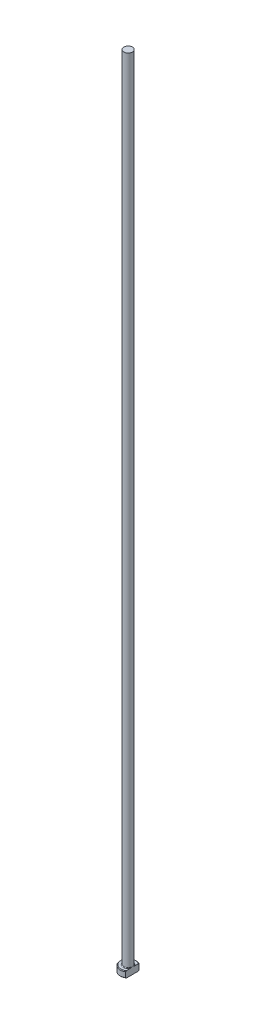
ISO-10303-21;
HEADER;
FILE_DESCRIPTION(('STEP AP214'),'2;1');
FILE_NAME('part.step','',(''),(''),'','','');
FILE_SCHEMA(('AUTOMOTIVE_DESIGN { 1 0 10303 214 1 1 1 1 }'));
ENDSEC;
DATA;
#1=APPLICATION_CONTEXT('core data for automotive mechanical design processes');
#2=APPLICATION_PROTOCOL_DEFINITION('international standard','automotive_design',2000,#1);
#3=PRODUCT_CONTEXT('',#1,'mechanical');
#4=PRODUCT('Part','Part','',(#3));
#5=PRODUCT_RELATED_PRODUCT_CATEGORY('part','',(#4));
#6=PRODUCT_DEFINITION_FORMATION('','',#4);
#7=PRODUCT_DEFINITION_CONTEXT('part definition',#1,'design');
#8=PRODUCT_DEFINITION('design','',#6,#7);
#9=PRODUCT_DEFINITION_SHAPE('','',#8);
#10=(LENGTH_UNIT() NAMED_UNIT(*) SI_UNIT(.MILLI.,.METRE.));
#11=(NAMED_UNIT(*) PLANE_ANGLE_UNIT() SI_UNIT($,.RADIAN.));
#12=(NAMED_UNIT(*) SI_UNIT($,.STERADIAN.) SOLID_ANGLE_UNIT());
#13=UNCERTAINTY_MEASURE_WITH_UNIT(LENGTH_MEASURE(1.E-05),#10,'distance_accuracy_value','');
#14=(GEOMETRIC_REPRESENTATION_CONTEXT(3) GLOBAL_UNCERTAINTY_ASSIGNED_CONTEXT((#13)) GLOBAL_UNIT_ASSIGNED_CONTEXT((#10,
#11,#12)) REPRESENTATION_CONTEXT('',''));
#15=CARTESIAN_POINT('',(0.,0.,0.));
#16=DIRECTION('',(0.,0.,1.));
#17=DIRECTION('',(1.,0.,0.));
#18=AXIS2_PLACEMENT_3D('',#15,#16,#17);
#19=CARTESIAN_POINT('',(0.,0.,0.));
#20=DIRECTION('',(0.,-1.,0.));
#21=DIRECTION('',(0.,0.,-1.));
#22=AXIS2_PLACEMENT_3D('',#19,#20,#21);
#23=PLANE('',#22);
#24=CARTESIAN_POINT('',(0.,0.,0.));
#25=DIRECTION('',(0.,-1.,0.));
#26=DIRECTION('',(0.,0.,-1.));
#27=AXIS2_PLACEMENT_3D('',#24,#25,#26);
#28=CIRCLE('',#27,2.3);
#29=CARTESIAN_POINT('',(1.34999999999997,0.,1.86212244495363));
#30=VERTEX_POINT('',#29);
#31=CARTESIAN_POINT('',(1.34999999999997,0.,-1.86212244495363));
#32=VERTEX_POINT('',#31);
#33=EDGE_CURVE('E98',#30,#32,#28,.T.);
#34=ORIENTED_EDGE('',*,*,#33,.T.);
#35=DIRECTION('',(0.,0.,1.));
#36=VECTOR('',#35,1.);
#37=CARTESIAN_POINT('',(1.34999999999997,0.,-2.10416254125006));
#38=LINE('',#37,#36);
#39=EDGE_CURVE('E83',#32,#30,#38,.T.);
#40=ORIENTED_EDGE('',*,*,#39,.T.);
#41=EDGE_LOOP('',(#34,#40));
#42=FACE_BOUND('',#41,.T.);
#43=ADVANCED_FACE('F32',(#42),#23,.T.);
#44=CARTESIAN_POINT('',(0.,259.958771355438,0.));
#45=DIRECTION('',(0.,1.,0.));
#46=DIRECTION('',(0.,0.,1.));
#47=AXIS2_PLACEMENT_3D('',#44,#45,#46);
#48=CYLINDRICAL_SURFACE('',#47,2.49999999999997);
#49=CARTESIAN_POINT('',(0.,1.79999999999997,0.));
#50=DIRECTION('',(0.,1.,0.));
#51=DIRECTION('',(0.,0.,1.));
#52=AXIS2_PLACEMENT_3D('',#49,#50,#51);
#53=CIRCLE('',#52,2.49999999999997);
#54=CARTESIAN_POINT('',(1.34999999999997,1.79999999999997,2.10416254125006));
#55=VERTEX_POINT('',#54);
#56=CARTESIAN_POINT('',(1.34999999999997,1.79999999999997,-2.10416254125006));
#57=VERTEX_POINT('',#56);
#58=EDGE_CURVE('E104',#55,#57,#53,.F.);
#59=ORIENTED_EDGE('',*,*,#58,.T.);
#60=DIRECTION('',(0.,-1.,0.));
#61=VECTOR('',#60,1.);
#62=CARTESIAN_POINT('',(1.34999999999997,250.,-2.10416254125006));
#63=LINE('',#62,#61);
#64=CARTESIAN_POINT('',(1.34999999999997,0.199999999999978,-2.10416254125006));
#65=VERTEX_POINT('',#64);
#66=EDGE_CURVE('E183',#57,#65,#63,.T.);
#67=ORIENTED_EDGE('',*,*,#66,.T.);
#68=CARTESIAN_POINT('',(0.,0.199999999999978,0.));
#69=DIRECTION('',(0.,-1.,0.));
#70=DIRECTION('',(0.,0.,-1.));
#71=AXIS2_PLACEMENT_3D('',#68,#69,#70);
#72=CIRCLE('',#71,2.49999999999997);
#73=CARTESIAN_POINT('',(1.34999999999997,0.199999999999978,2.10416254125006));
#74=VERTEX_POINT('',#73);
#75=EDGE_CURVE('E100',#65,#74,#72,.F.);
#76=ORIENTED_EDGE('',*,*,#75,.T.);
#77=DIRECTION('',(0.,-1.,0.));
#78=VECTOR('',#77,1.);
#79=CARTESIAN_POINT('',(1.34999999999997,250.,2.10416254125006));
#80=LINE('',#79,#78);
#81=EDGE_CURVE('E93',#55,#74,#80,.T.);
#82=ORIENTED_EDGE('',*,*,#81,.F.);
#83=EDGE_LOOP('',(#59,#67,#76,#82));
#84=FACE_BOUND('',#83,.T.);
#85=ADVANCED_FACE('F158',(#84),#48,.T.);
#86=CARTESIAN_POINT('',(-2.49999999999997,2.,0.));
#87=DIRECTION('',(0.,1.,0.));
#88=DIRECTION('',(0.,0.,1.));
#89=AXIS2_PLACEMENT_3D('',#86,#87,#88);
#90=PLANE('',#89);
#91=CARTESIAN_POINT('',(0.,2.,0.));
#92=DIRECTION('',(0.,1.,0.));
#93=DIRECTION('',(0.,0.,1.));
#94=AXIS2_PLACEMENT_3D('',#91,#92,#93);
#95=CIRCLE('',#94,2.29999999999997);
#96=CARTESIAN_POINT('',(1.34999999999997,2.,-1.86212244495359));
#97=VERTEX_POINT('',#96);
#98=CARTESIAN_POINT('',(1.34999999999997,2.,1.86212244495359));
#99=VERTEX_POINT('',#98);
#100=EDGE_CURVE('E178',#97,#99,#95,.T.);
#101=ORIENTED_EDGE('',*,*,#100,.T.);
#102=DIRECTION('',(0.,0.,-1.));
#103=VECTOR('',#102,1.);
#104=CARTESIAN_POINT('',(1.34999999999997,2.,0.));
#105=LINE('',#104,#103);
#106=CARTESIAN_POINT('',(1.34999999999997,1.99999999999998,0.761577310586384));
#107=VERTEX_POINT('',#106);
#108=EDGE_CURVE('E57',#99,#107,#105,.T.);
#109=ORIENTED_EDGE('',*,*,#108,.T.);
#110=CARTESIAN_POINT('',(0.,2.,0.));
#111=DIRECTION('',(0.,1.,0.));
#112=DIRECTION('',(0.,0.,1.));
#113=AXIS2_PLACEMENT_3D('',#110,#111,#112);
#114=CIRCLE('',#113,1.54999999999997);
#115=CARTESIAN_POINT('',(1.34999999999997,1.99999999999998,-0.761577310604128));
#116=VERTEX_POINT('',#115);
#117=EDGE_CURVE('E107',#107,#116,#114,.F.);
#118=ORIENTED_EDGE('',*,*,#117,.T.);
#119=EDGE_CURVE('E136',#116,#97,#105,.T.);
#120=ORIENTED_EDGE('',*,*,#119,.T.);
#121=EDGE_LOOP('',(#101,#109,#118,#120));
#122=FACE_BOUND('',#121,.T.);
#123=ADVANCED_FACE('F147',(#122),#90,.T.);
#124=CARTESIAN_POINT('',(0.,2.,0.));
#125=DIRECTION('',(0.,-1.,0.));
#126=DIRECTION('',(0.,0.,-1.));
#127=AXIS2_PLACEMENT_3D('',#124,#125,#126);
#128=CONICAL_SURFACE('',#127,2.29999999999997,0.785398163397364);
#129=ORIENTED_EDGE('',*,*,#58,.F.);
#130=CARTESIAN_POINT('',(1.34999999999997,-0.524919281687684,4.63220747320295));
#131=CARTESIAN_POINT('',(1.34999999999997,-0.43760934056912,4.54126266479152));
#132=CARTESIAN_POINT('',(1.34999999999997,-0.350401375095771,4.45021982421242));
#133=CARTESIAN_POINT('',(1.34999999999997,-0.176235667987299,4.26789371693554));
#134=CARTESIAN_POINT('',(1.34999999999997,-0.0892779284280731,4.17661044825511));
#135=CARTESIAN_POINT('',(1.34999999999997,0.171198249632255,3.90228319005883));
#136=CARTESIAN_POINT('',(1.34999999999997,0.344269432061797,3.71881394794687));
#137=CARTESIAN_POINT('',(1.34999999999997,0.686339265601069,3.35265578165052));
#138=CARTESIAN_POINT('',(1.34999999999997,0.855361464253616,3.16998895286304));
#139=CARTESIAN_POINT('',(1.34999999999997,1.10676804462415,2.89407002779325));
#140=CARTESIAN_POINT('',(1.34999999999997,1.19021072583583,2.8017829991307));
#141=CARTESIAN_POINT('',(1.34999999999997,1.35616107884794,2.61637299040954));
#142=CARTESIAN_POINT('',(1.34999999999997,1.4386687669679,2.52325002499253));
#143=CARTESIAN_POINT('',(1.34999999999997,1.5866650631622,2.35393986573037));
#144=CARTESIAN_POINT('',(1.34999999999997,1.65237203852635,2.27794381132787));
#145=CARTESIAN_POINT('',(1.34999999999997,1.78272599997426,2.12503384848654));
#146=CARTESIAN_POINT('',(1.34999999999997,1.84737288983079,2.04811985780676));
#147=CARTESIAN_POINT('',(1.34999999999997,1.97578051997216,1.8924719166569));
#148=CARTESIAN_POINT('',(1.34999999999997,2.03952939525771,1.81372814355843));
#149=CARTESIAN_POINT('',(1.34999999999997,2.16502964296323,1.65468665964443));
#150=CARTESIAN_POINT('',(1.34999999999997,2.22678149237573,1.57438932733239));
#151=CARTESIAN_POINT('',(1.34999999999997,2.34821109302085,1.41068778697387));
#152=CARTESIAN_POINT('',(1.34999999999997,2.40785394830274,1.32725749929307));
#153=CARTESIAN_POINT('',(1.34999999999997,2.52292072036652,1.15733795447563));
#154=CARTESIAN_POINT('',(1.34999999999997,2.57833930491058,1.07084502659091));
#155=CARTESIAN_POINT('',(1.34999999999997,2.68200172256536,0.894688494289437));
#156=CARTESIAN_POINT('',(1.34999999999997,2.73030792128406,0.805062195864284));
#157=CARTESIAN_POINT('',(1.34999999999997,2.81628592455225,0.620872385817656));
#158=CARTESIAN_POINT('',(1.34999999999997,2.85398889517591,0.526324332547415));
#159=CARTESIAN_POINT('',(1.34999999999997,2.89712682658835,0.383943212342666));
#160=CARTESIAN_POINT('',(1.34999999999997,2.90904798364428,0.338082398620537));
#161=CARTESIAN_POINT('',(1.34999999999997,2.92861548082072,0.245444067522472));
#162=CARTESIAN_POINT('',(1.34999999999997,2.93626244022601,0.198666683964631));
#163=CARTESIAN_POINT('',(1.34999999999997,2.94673600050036,0.104809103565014));
#164=CARTESIAN_POINT('',(1.34999999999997,2.94958722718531,0.0577317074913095));
#165=CARTESIAN_POINT('',(1.34999999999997,2.95032901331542,-0.0364641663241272));
#166=CARTESIAN_POINT('',(1.34999999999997,2.94821949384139,-0.0835826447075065));
#167=CARTESIAN_POINT('',(1.34999999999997,2.93922391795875,-0.177115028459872));
#168=CARTESIAN_POINT('',(1.34999999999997,2.93236161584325,-0.223531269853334));
#169=CARTESIAN_POINT('',(1.34999999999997,2.91435204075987,-0.315528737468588));
#170=CARTESIAN_POINT('',(1.34999999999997,2.90320298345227,-0.361109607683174));
#171=CARTESIAN_POINT('',(1.34999999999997,2.87715789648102,-0.451518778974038));
#172=CARTESIAN_POINT('',(1.34999999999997,2.86223608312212,-0.49633953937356));
#173=CARTESIAN_POINT('',(1.34999999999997,2.82934295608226,-0.584823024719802));
#174=CARTESIAN_POINT('',(1.34999999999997,2.8113721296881,-0.628485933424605));
#175=CARTESIAN_POINT('',(1.34999999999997,2.75847247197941,-0.747269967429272));
#176=CARTESIAN_POINT('',(1.34999999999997,2.72098585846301,-0.82124736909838));
#177=CARTESIAN_POINT('',(1.34999999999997,2.6408629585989,-0.966383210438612));
#178=CARTESIAN_POINT('',(1.34999999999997,2.59822112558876,-1.03753850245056));
#179=CARTESIAN_POINT('',(1.34999999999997,2.50923184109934,-1.17783613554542));
#180=CARTESIAN_POINT('',(1.34999999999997,2.46287145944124,-1.24697020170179));
#181=CARTESIAN_POINT('',(1.34999999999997,2.3676446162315,-1.38343072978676));
#182=CARTESIAN_POINT('',(1.34999999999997,2.31877921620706,-1.45075793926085));
#183=CARTESIAN_POINT('',(1.34999999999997,2.2185885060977,-1.58486082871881));
#184=CARTESIAN_POINT('',(1.34999999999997,2.16724014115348,-1.6516192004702));
#185=CARTESIAN_POINT('',(1.34999999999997,2.0631299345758,-1.7840271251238));
#186=CARTESIAN_POINT('',(1.34999999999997,2.01036799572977,-1.84967660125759));
#187=CARTESIAN_POINT('',(1.34999999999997,1.85072242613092,-2.04502635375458));
#188=CARTESIAN_POINT('',(1.34999999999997,1.74225068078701,-2.17342678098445));
#189=CARTESIAN_POINT('',(1.34999999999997,1.54426345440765,-2.40295980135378));
#190=CARTESIAN_POINT('',(1.34999999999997,1.45520943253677,-2.50449462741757));
#191=CARTESIAN_POINT('',(1.34999999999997,1.27587070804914,-2.7064765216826));
#192=CARTESIAN_POINT('',(1.34999999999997,1.18558597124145,-2.80692355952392));
#193=CARTESIAN_POINT('',(1.34999999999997,0.913238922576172,-3.10722245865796));
#194=CARTESIAN_POINT('',(1.34999999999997,0.729836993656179,-3.30585698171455));
#195=CARTESIAN_POINT('',(1.34999999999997,0.368419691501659,-3.69315491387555));
#196=CARTESIAN_POINT('',(1.34999999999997,0.190487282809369,-3.88189615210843));
#197=CARTESIAN_POINT('',(1.34999999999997,-0.0772724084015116,-4.16399820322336));
#198=CARTESIAN_POINT('',(1.34999999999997,-0.166621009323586,-4.25781388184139));
#199=CARTESIAN_POINT('',(1.34999999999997,-0.345583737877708,-4.4451899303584));
#200=CARTESIAN_POINT('',(1.34999999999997,-0.435197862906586,-4.53875030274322));
#201=CARTESIAN_POINT('',(1.34999999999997,-0.524919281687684,-4.63220747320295));
#202=B_SPLINE_CURVE_WITH_KNOTS('',3,(#130,#131,#132,#133,#134,#135,#136,#137,#138,#139,#140,
#141,#142,#143,#144,#145,#146,#147,#148,#149,#150,#151,#152,#153,#154,#155,#156,#157,#158,#159,
#160,#161,#162,#163,#164,#165,#166,#167,#168,#169,#170,#171,#172,#173,#174,#175,#176,#177,#178,
#179,#180,#181,#182,#183,#184,#185,#186,#187,#188,#189,#190,#191,#192,#193,#194,#195,#196,#197,
#198,#199,#200,#201),.UNSPECIFIED.,.F.,.F.,(4,2,2,2,2,2,2,2,2,2,2,2,2,2,2,2,2,2,2,2,2,2,2,2,2,2,
2,2,2,2,2,2,2,2,2,4),(0.,0.378214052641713,0.756431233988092,1.51308288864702,2.25966743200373,
2.63291386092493,3.00615376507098,3.3075353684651,3.60894417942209,3.91286335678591,
4.21670939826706,4.52429630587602,4.83226525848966,5.13734835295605,5.44152511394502,
5.58351223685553,5.72547878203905,5.86671408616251,6.00795163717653,6.14848833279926,
6.2890835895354,6.43066697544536,6.57222775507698,6.82069043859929,7.06942287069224,
7.31906118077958,7.56859456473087,7.82123528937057,8.07389343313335,8.57808208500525,
8.98323970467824,9.38840860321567,10.1994443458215,10.977607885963,11.3662730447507,
11.7549344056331),.UNSPECIFIED.);
#203=EDGE_CURVE('E135',#55,#99,#202,.T.);
#204=ORIENTED_EDGE('',*,*,#203,.T.);
#205=ORIENTED_EDGE('',*,*,#100,.F.);
#206=EDGE_CURVE('E127',#97,#57,#202,.T.);
#207=ORIENTED_EDGE('',*,*,#206,.T.);
#208=EDGE_LOOP('',(#129,#204,#205,#207));
#209=FACE_BOUND('',#208,.T.);
#210=ADVANCED_FACE('F143',(#209),#128,.T.);
#211=CARTESIAN_POINT('',(0.,0.199999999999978,0.));
#212=DIRECTION('',(0.,1.,0.));
#213=DIRECTION('',(0.,0.,1.));
#214=AXIS2_PLACEMENT_3D('',#211,#212,#213);
#215=CONICAL_SURFACE('',#214,2.49999999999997,0.785398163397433);
#216=ORIENTED_EDGE('',*,*,#75,.F.);
#217=CARTESIAN_POINT('',(1.34999999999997,2.52491928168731,-4.63220747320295));
#218=CARTESIAN_POINT('',(1.34999999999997,2.43760934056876,-4.54126266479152));
#219=CARTESIAN_POINT('',(1.34999999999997,2.35040137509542,-4.45021982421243));
#220=CARTESIAN_POINT('',(1.34999999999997,2.17623566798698,-4.26789371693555));
#221=CARTESIAN_POINT('',(1.34999999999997,2.08927792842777,-4.17661044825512));
#222=CARTESIAN_POINT('',(1.34999999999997,1.82880175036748,-3.90228319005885));
#223=CARTESIAN_POINT('',(1.34999999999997,1.65573056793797,-3.71881394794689));
#224=CARTESIAN_POINT('',(1.34999999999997,1.31366073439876,-3.35265578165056));
#225=CARTESIAN_POINT('',(1.34999999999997,1.14463853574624,-3.16998895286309));
#226=CARTESIAN_POINT('',(1.34999999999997,0.893231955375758,-2.89407002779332));
#227=CARTESIAN_POINT('',(1.34999999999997,0.809789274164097,-2.80178299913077));
#228=CARTESIAN_POINT('',(1.34999999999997,0.643838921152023,-2.61637299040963));
#229=CARTESIAN_POINT('',(1.34999999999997,0.561331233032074,-2.52325002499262));
#230=CARTESIAN_POINT('',(1.34999999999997,0.41333493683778,-2.35393986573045));
#231=CARTESIAN_POINT('',(1.34999999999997,0.347627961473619,-2.27794381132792));
#232=CARTESIAN_POINT('',(1.34999999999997,0.217274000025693,-2.12503384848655));
#233=CARTESIAN_POINT('',(1.34999999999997,0.152627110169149,-2.04811985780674));
#234=CARTESIAN_POINT('',(1.34999999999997,0.0242194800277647,-1.89247191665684));
#235=CARTESIAN_POINT('',(1.34999999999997,-0.0395293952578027,-1.81372814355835));
#236=CARTESIAN_POINT('',(1.34999999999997,-0.165029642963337,-1.6546866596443));
#237=CARTESIAN_POINT('',(1.34999999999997,-0.226781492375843,-1.57438932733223));
#238=CARTESIAN_POINT('',(1.34999999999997,-0.348211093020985,-1.41068778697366));
#239=CARTESIAN_POINT('',(1.34999999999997,-0.407853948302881,-1.32725749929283));
#240=CARTESIAN_POINT('',(1.34999999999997,-0.522920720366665,-1.15733795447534));
#241=CARTESIAN_POINT('',(1.34999999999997,-0.57833930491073,-1.07084502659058));
#242=CARTESIAN_POINT('',(1.34999999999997,-0.682001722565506,-0.894688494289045));
#243=CARTESIAN_POINT('',(1.34999999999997,-0.730307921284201,-0.80506219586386));
#244=CARTESIAN_POINT('',(1.34999999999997,-0.816285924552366,-0.620872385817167));
#245=CARTESIAN_POINT('',(1.34999999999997,-0.853988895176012,-0.526324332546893));
#246=CARTESIAN_POINT('',(1.34999999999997,-0.897126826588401,-0.383943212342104));
#247=CARTESIAN_POINT('',(1.34999999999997,-0.909047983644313,-0.33808239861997));
#248=CARTESIAN_POINT('',(1.34999999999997,-0.928615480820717,-0.245444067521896));
#249=CARTESIAN_POINT('',(1.34999999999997,-0.936262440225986,-0.198666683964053));
#250=CARTESIAN_POINT('',(1.34999999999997,-0.946736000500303,-0.104809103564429));
#251=CARTESIAN_POINT('',(1.34999999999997,-0.949587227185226,-0.0577317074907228));
#252=CARTESIAN_POINT('',(1.34999999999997,-0.950329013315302,0.0364641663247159));
#253=CARTESIAN_POINT('',(1.34999999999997,-0.948219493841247,0.0835826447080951));
#254=CARTESIAN_POINT('',(1.34999999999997,-0.939223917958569,0.177115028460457));
#255=CARTESIAN_POINT('',(1.34999999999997,-0.932361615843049,0.223531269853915));
#256=CARTESIAN_POINT('',(1.34999999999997,-0.914352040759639,0.315528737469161));
#257=CARTESIAN_POINT('',(1.34999999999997,-0.903202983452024,0.361109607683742));
#258=CARTESIAN_POINT('',(1.34999999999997,-0.877157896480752,0.451518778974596));
#259=CARTESIAN_POINT('',(1.34999999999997,-0.862236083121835,0.496339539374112));
#260=CARTESIAN_POINT('',(1.34999999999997,-0.82934295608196,0.584823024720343));
#261=CARTESIAN_POINT('',(1.34999999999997,-0.811372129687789,0.628485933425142));
#262=CARTESIAN_POINT('',(1.34999999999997,-0.758472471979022,0.747269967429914));
#263=CARTESIAN_POINT('',(1.34999999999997,-0.72098585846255,0.821247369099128));
#264=CARTESIAN_POINT('',(1.34999999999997,-0.640862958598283,0.966383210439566));
#265=CARTESIAN_POINT('',(1.34999999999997,-0.598221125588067,1.03753850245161));
#266=CARTESIAN_POINT('',(1.34999999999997,-0.509231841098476,1.17783613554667));
#267=CARTESIAN_POINT('',(1.34999999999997,-0.462871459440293,1.24697020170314));
#268=CARTESIAN_POINT('',(1.34999999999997,-0.367644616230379,1.3834307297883));
#269=CARTESIAN_POINT('',(1.34999999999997,-0.318779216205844,1.45075793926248));
#270=CARTESIAN_POINT('',(1.34999999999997,-0.21858850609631,1.58486082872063));
#271=CARTESIAN_POINT('',(1.34999999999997,-0.167240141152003,1.65161920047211));
#272=CARTESIAN_POINT('',(1.34999999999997,-0.0631299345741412,1.7840271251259));
#273=CARTESIAN_POINT('',(1.34999999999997,-0.0103679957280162,1.84967660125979));
#274=CARTESIAN_POINT('',(1.34999999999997,0.149277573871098,2.04502635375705));
#275=CARTESIAN_POINT('',(1.34999999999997,0.257749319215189,2.17342678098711));
#276=CARTESIAN_POINT('',(1.34999999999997,0.455736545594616,2.40295980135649));
#277=CARTESIAN_POINT('',(1.34999999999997,0.544790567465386,2.50449462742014));
#278=CARTESIAN_POINT('',(1.34999999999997,0.724129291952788,2.70647652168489));
#279=CARTESIAN_POINT('',(1.34999999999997,0.814414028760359,2.80692355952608));
#280=CARTESIAN_POINT('',(1.34999999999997,1.08676107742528,3.10722245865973));
#281=CARTESIAN_POINT('',(1.34999999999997,1.27016300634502,3.30585698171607));
#282=CARTESIAN_POINT('',(1.34999999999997,1.63158030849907,3.6931549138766));
#283=CARTESIAN_POINT('',(1.34999999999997,1.80951271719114,3.88189615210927));
#284=CARTESIAN_POINT('',(1.34999999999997,2.07727240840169,4.16399820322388));
#285=CARTESIAN_POINT('',(1.34999999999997,2.16662100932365,4.2578138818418));
#286=CARTESIAN_POINT('',(1.34999999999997,2.34558373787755,4.44518993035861));
#287=CARTESIAN_POINT('',(1.34999999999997,2.43519786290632,4.53875030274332));
#288=CARTESIAN_POINT('',(1.34999999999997,2.52491928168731,4.63220747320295));
#289=B_SPLINE_CURVE_WITH_KNOTS('',3,(#217,#218,#219,#220,#221,#222,#223,#224,#225,#226,#227,
#228,#229,#230,#231,#232,#233,#234,#235,#236,#237,#238,#239,#240,#241,#242,#243,#244,#245,#246,
#247,#248,#249,#250,#251,#252,#253,#254,#255,#256,#257,#258,#259,#260,#261,#262,#263,#264,#265,
#266,#267,#268,#269,#270,#271,#272,#273,#274,#275,#276,#277,#278,#279,#280,#281,#282,#283,#284,
#285,#286,#287,#288),.UNSPECIFIED.,.F.,.F.,(4,2,2,2,2,2,2,2,2,2,2,2,2,2,2,2,2,2,2,2,2,2,2,2,2,2,
2,2,2,2,2,2,2,2,2,4),(0.,0.378214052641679,0.756431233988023,1.51308288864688,2.2596674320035,
2.63291386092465,3.00615376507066,3.30753536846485,3.60894417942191,3.91286335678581,
4.21670939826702,4.52429630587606,4.83226525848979,5.13734835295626,5.4415251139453,
5.58351223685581,5.72547878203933,5.86671408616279,6.00795163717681,6.14848833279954,
6.28908358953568,6.43066697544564,6.57222775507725,6.82069043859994,7.06942287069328,
7.319061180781,7.56859456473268,7.82123528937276,8.07389343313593,8.5780820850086,
8.98323970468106,9.38840860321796,10.1994443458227,10.9776078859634,11.3662730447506,
11.7549344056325),.UNSPECIFIED.);
#290=EDGE_CURVE('E86',#65,#32,#289,.T.);
#291=ORIENTED_EDGE('',*,*,#290,.T.);
#292=ORIENTED_EDGE('',*,*,#33,.F.);
#293=EDGE_CURVE('E89',#30,#74,#289,.T.);
#294=ORIENTED_EDGE('',*,*,#293,.T.);
#295=EDGE_LOOP('',(#216,#291,#292,#294));
#296=FACE_BOUND('',#295,.T.);
#297=ADVANCED_FACE('F97',(#296),#215,.T.);
#298=CARTESIAN_POINT('',(0.,2.19999999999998,0.));
#299=DIRECTION('',(0.,1.,0.));
#300=DIRECTION('',(0.,0.,1.));
#301=AXIS2_PLACEMENT_3D('',#298,#299,#300);
#302=TOROIDAL_SURFACE('',#301,1.54999999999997,0.2);
#303=CARTESIAN_POINT('',(1.34999999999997,2.19999999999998,0.));
#304=CARTESIAN_POINT('',(1.34999999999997,2.20000051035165,-6.93386413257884E-11));
#305=CARTESIAN_POINT('',(1.34999999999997,2.20000102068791,-1.14040096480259E-07));
#306=CARTESIAN_POINT('',(1.34999999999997,2.2000020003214,-4.70904764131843E-07));
#307=CARTESIAN_POINT('',(1.34999999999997,2.20000246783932,-7.1771368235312E-07));
#308=CARTESIAN_POINT('',(1.34999999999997,2.20000340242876,-1.30966222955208E-06));
#309=CARTESIAN_POINT('',(1.34999999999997,2.20000386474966,-1.662182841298E-06));
#310=CARTESIAN_POINT('',(1.34999999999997,2.20000473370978,-2.41969342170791E-06));
#311=CARTESIAN_POINT('',(1.34999999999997,2.20000514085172,-2.82413349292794E-06));
#312=CARTESIAN_POINT('',(1.34999999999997,2.20000651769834,-4.28387658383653E-06));
#313=CARTESIAN_POINT('',(1.34999999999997,2.20000741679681,-5.40686565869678E-06));
#314=CARTESIAN_POINT('',(1.34999999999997,2.20000900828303,-7.71855157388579E-06));
#315=CARTESIAN_POINT('',(1.34999999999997,2.20000970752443,-8.90279582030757E-06));
#316=CARTESIAN_POINT('',(1.34999999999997,2.20001236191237,-1.3560882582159E-05));
#317=CARTESIAN_POINT('',(1.34999999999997,2.20001418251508,-1.71153577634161E-05));
#318=CARTESIAN_POINT('',(1.34999999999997,2.20001713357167,-2.4096378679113E-05));
#319=CARTESIAN_POINT('',(1.34999999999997,2.20001831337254,-2.75026560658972E-05));
#320=CARTESIAN_POINT('',(1.34999999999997,2.20002337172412,-4.21136205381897E-05));
#321=CARTESIAN_POINT('',(1.34999999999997,2.20002724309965,-5.33128878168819E-05));
#322=CARTESIAN_POINT('',(1.34999999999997,2.20003341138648,-7.4213259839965E-05));
#323=CARTESIAN_POINT('',(1.34999999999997,2.20003586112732,-8.38672294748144E-05));
#324=CARTESIAN_POINT('',(1.34999999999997,2.20005538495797,-0.000154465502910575));
#325=CARTESIAN_POINT('',(1.34999999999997,2.20008043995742,-0.000212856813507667));
#326=CARTESIAN_POINT('',(1.34999999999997,2.20017457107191,-0.000440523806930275));
#327=CARTESIAN_POINT('',(1.34999999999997,2.2002377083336,-0.000611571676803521));
#328=CARTESIAN_POINT('',(1.34999999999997,2.20048725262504,-0.00127779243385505));
#329=CARTESIAN_POINT('',(1.34999999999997,2.2006798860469,-0.00177115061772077));
#330=CARTESIAN_POINT('',(1.34999999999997,2.20146612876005,-0.00379437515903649));
#331=CARTESIAN_POINT('',(1.34999999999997,2.20205268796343,-0.0053262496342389));
#332=CARTESIAN_POINT('',(1.34999999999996,2.20919457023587,-0.0239661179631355));
#333=CARTESIAN_POINT('',(1.34999999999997,2.21579238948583,-0.0410623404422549));
#334=CARTESIAN_POINT('',(1.34999999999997,2.22866578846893,-0.074650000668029));
#335=CARTESIAN_POINT('',(1.34999999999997,2.23494426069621,-0.0911404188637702));
#336=CARTESIAN_POINT('',(1.34999999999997,2.24814459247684,-0.126093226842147));
#337=CARTESIAN_POINT('',(1.34999999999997,2.25505545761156,-0.144559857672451));
#338=CARTESIAN_POINT('',(1.34999999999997,2.26876393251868,-0.181748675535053));
#339=CARTESIAN_POINT('',(1.34999999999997,2.27555967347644,-0.200471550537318));
#340=CARTESIAN_POINT('',(1.34999999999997,2.29202668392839,-0.246805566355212));
#341=CARTESIAN_POINT('',(1.34999999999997,2.30155256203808,-0.274468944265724));
#342=CARTESIAN_POINT('',(1.34999999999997,2.31961149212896,-0.329392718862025));
#343=CARTESIAN_POINT('',(1.34999999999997,2.32816274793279,-0.356647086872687));
#344=CARTESIAN_POINT('',(1.34999999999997,2.34540016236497,-0.415248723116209));
#345=CARTESIAN_POINT('',(1.34999999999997,2.35394063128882,-0.446639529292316));
#346=CARTESIAN_POINT('',(1.34999999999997,2.36937995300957,-0.510082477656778));
#347=CARTESIAN_POINT('',(1.34999999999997,2.3762658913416,-0.542137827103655));
#348=CARTESIAN_POINT('',(1.34999999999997,2.38814240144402,-0.608749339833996));
#349=CARTESIAN_POINT('',(1.34999999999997,2.39298194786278,-0.64333337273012));
#350=CARTESIAN_POINT('',(1.34999999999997,2.39922141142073,-0.712731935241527));
#351=CARTESIAN_POINT('',(1.34999999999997,2.40063314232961,-0.747545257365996));
#352=CARTESIAN_POINT('',(1.34999999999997,2.39899063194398,-0.811125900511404));
#353=CARTESIAN_POINT('',(1.34999999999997,2.39665955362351,-0.839907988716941));
#354=CARTESIAN_POINT('',(1.34999999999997,2.3878724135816,-0.896503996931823));
#355=CARTESIAN_POINT('',(1.34999999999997,2.3814773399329,-0.924325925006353));
#356=CARTESIAN_POINT('',(1.34999999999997,2.36777648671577,-0.964713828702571));
#357=CARTESIAN_POINT('',(1.34999999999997,2.36251387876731,-0.977971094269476));
#358=CARTESIAN_POINT('',(1.34999999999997,2.35035650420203,-1.00376929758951));
#359=CARTESIAN_POINT('',(1.34999999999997,2.34345879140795,-1.01630889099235));
#360=CARTESIAN_POINT('',(1.34999999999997,2.329139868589,-1.03811283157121));
#361=CARTESIAN_POINT('',(1.34999999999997,2.32201405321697,-1.04756908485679));
#362=CARTESIAN_POINT('',(1.34999999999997,2.30635495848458,-1.06523411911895));
#363=CARTESIAN_POINT('',(1.34999999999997,2.29782508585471,-1.07344582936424));
#364=CARTESIAN_POINT('',(1.34999999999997,2.28196145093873,-1.08598464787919));
#365=CARTESIAN_POINT('',(1.34999999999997,2.274977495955,-1.09075233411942));
#366=CARTESIAN_POINT('',(1.34999999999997,2.26033012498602,-1.09910941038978));
#367=CARTESIAN_POINT('',(1.34999999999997,2.25266710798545,-1.10269948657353));
#368=CARTESIAN_POINT('',(1.34999999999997,2.23673989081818,-1.1084681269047));
#369=CARTESIAN_POINT('',(1.34999999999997,2.22847092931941,-1.1106337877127));
#370=CARTESIAN_POINT('',(1.34999999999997,2.21166869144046,-1.11329753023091));
#371=CARTESIAN_POINT('',(1.34999999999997,2.20313564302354,-1.11379701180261));
#372=CARTESIAN_POINT('',(1.34999999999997,2.18727799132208,-1.11313057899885));
#373=CARTESIAN_POINT('',(1.34999999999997,2.17994351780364,-1.11217719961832));
#374=CARTESIAN_POINT('',(1.34999999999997,2.16553907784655,-1.10905798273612));
#375=CARTESIAN_POINT('',(1.34999999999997,2.15846915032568,-1.10689196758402));
#376=CARTESIAN_POINT('',(1.34999999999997,2.14470559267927,-1.10147189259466));
#377=CARTESIAN_POINT('',(1.34999999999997,2.13801509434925,-1.09820998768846));
#378=CARTESIAN_POINT('',(1.34999999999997,2.12516220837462,-1.0907816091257));
#379=CARTESIAN_POINT('',(1.34999999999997,2.119000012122,-1.08661480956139));
#380=CARTESIAN_POINT('',(1.34999999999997,2.10390058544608,-1.07497116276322));
#381=CARTESIAN_POINT('',(1.34999999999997,2.09537574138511,-1.06695869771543));
#382=CARTESIAN_POINT('',(1.34999999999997,2.07969650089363,-1.04968237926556));
#383=CARTESIAN_POINT('',(1.34999999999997,2.07254642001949,-1.04041473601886));
#384=CARTESIAN_POINT('',(1.34999999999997,2.0559393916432,-1.01572772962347));
#385=CARTESIAN_POINT('',(1.34999999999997,2.04736349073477,-0.99971889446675));
#386=CARTESIAN_POINT('',(1.34999999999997,2.03274927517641,-0.966649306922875));
#387=CARTESIAN_POINT('',(1.34999999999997,2.02670979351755,-0.949589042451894));
#388=CARTESIAN_POINT('',(1.34999999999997,2.01301888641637,-0.902192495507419));
#389=CARTESIAN_POINT('',(1.34999999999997,2.00741820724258,-0.871270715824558));
#390=CARTESIAN_POINT('',(1.34999999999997,2.0006455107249,-0.808563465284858));
#391=CARTESIAN_POINT('',(1.34999999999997,1.99954416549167,-0.776772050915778));
#392=CARTESIAN_POINT('',(1.34999999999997,2.00095999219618,-0.704102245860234));
#393=CARTESIAN_POINT('',(1.34999999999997,2.00461462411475,-0.663252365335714));
#394=CARTESIAN_POINT('',(1.34999999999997,2.01597234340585,-0.582010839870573));
#395=CARTESIAN_POINT('',(1.34999999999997,2.02369178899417,-0.54162172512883));
#396=CARTESIAN_POINT('',(1.34999999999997,2.04136563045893,-0.464405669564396));
#397=CARTESIAN_POINT('',(1.34999999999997,2.05111943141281,-0.427531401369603));
#398=CARTESIAN_POINT('',(1.34999999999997,2.07231971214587,-0.354637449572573));
#399=CARTESIAN_POINT('',(1.34999999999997,2.08375041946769,-0.318613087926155));
#400=CARTESIAN_POINT('',(1.34999999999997,2.1024239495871,-0.263006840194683));
#401=CARTESIAN_POINT('',(1.34999999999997,2.10925115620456,-0.243282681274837));
#402=CARTESIAN_POINT('',(1.34999999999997,2.12336489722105,-0.203437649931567));
#403=CARTESIAN_POINT('',(1.34999999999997,2.13065867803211,-0.183319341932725));
#404=CARTESIAN_POINT('',(1.34999999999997,2.14313587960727,-0.149463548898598));
#405=CARTESIAN_POINT('',(1.34999999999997,2.1482631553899,-0.135705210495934));
#406=CARTESIAN_POINT('',(1.34999999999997,2.15854219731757,-0.108353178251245));
#407=CARTESIAN_POINT('',(1.34999999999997,2.16369321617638,-0.0947592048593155));
#408=CARTESIAN_POINT('',(1.34999999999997,2.17349784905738,-0.0690071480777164));
#409=CARTESIAN_POINT('',(1.34999999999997,2.17814722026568,-0.0568473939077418));
#410=CARTESIAN_POINT('',(1.34999999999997,2.18766064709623,-0.0320803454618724));
#411=CARTESIAN_POINT('',(1.34999999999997,2.1925261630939,-0.019473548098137));
#412=CARTESIAN_POINT('',(1.34999999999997,2.19794687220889,-0.00532758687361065));
#413=CARTESIAN_POINT('',(1.34999999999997,2.19853287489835,-0.00379701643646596));
#414=CARTESIAN_POINT('',(1.34999999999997,2.19931897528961,-0.00177410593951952));
#415=CARTESIAN_POINT('',(1.34999999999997,2.19951199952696,-0.00127975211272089));
#416=CARTESIAN_POINT('',(1.34999999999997,2.19976201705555,-0.000612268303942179));
#417=CARTESIAN_POINT('',(1.34999999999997,2.19982525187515,-0.000440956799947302));
#418=CARTESIAN_POINT('',(1.34999999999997,2.19991951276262,-0.000212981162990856));
#419=CARTESIAN_POINT('',(1.34999999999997,2.19994458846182,-0.000154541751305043));
#420=CARTESIAN_POINT('',(1.34999999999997,2.19996412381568,-8.38889589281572E-05));
#421=CARTESIAN_POINT('',(1.34999999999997,2.19996657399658,-7.42314656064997E-05));
#422=CARTESIAN_POINT('',(1.34999999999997,2.1999727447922,-5.33232983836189E-05));
#423=CARTESIAN_POINT('',(1.34999999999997,2.19997661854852,-4.21198546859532E-05));
#424=CARTESIAN_POINT('',(1.34999999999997,2.19998167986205,-2.75042074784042E-05));
#425=CARTESIAN_POINT('',(1.34999999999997,2.19998286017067,-2.40973903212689E-05));
#426=CARTESIAN_POINT('',(1.34999999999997,2.19998581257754,-1.71153452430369E-05));
#427=CARTESIAN_POINT('',(1.34999999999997,2.19998763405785,-1.35604061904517E-05));
#428=CARTESIAN_POINT('',(1.34999999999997,2.19999028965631,-8.90187906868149E-06));
#429=CARTESIAN_POINT('',(1.34999999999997,2.19999098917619,-7.7175929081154E-06));
#430=CARTESIAN_POINT('',(1.34999999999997,2.19999258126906,-5.40587786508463E-06));
#431=CARTESIAN_POINT('',(1.34999999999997,2.19999348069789,-4.28290463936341E-06));
#432=CARTESIAN_POINT('',(1.34999999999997,2.19999485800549,-2.82324857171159E-06));
#433=CARTESIAN_POINT('',(1.34999999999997,2.19999526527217,-2.41884666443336E-06));
#434=CARTESIAN_POINT('',(1.34999999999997,2.19999613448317,-1.66143479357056E-06));
#435=CARTESIAN_POINT('',(1.34999999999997,2.19999659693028,-1.30897501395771E-06));
#436=CARTESIAN_POINT('',(1.34999999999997,2.19999753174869,-7.17173367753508E-07));
#437=CARTESIAN_POINT('',(1.34999999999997,2.19999799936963,-4.70447275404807E-07));
#438=CARTESIAN_POINT('',(1.34999999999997,2.19999897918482,-1.13784244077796E-07));
#439=CARTESIAN_POINT('',(1.34999999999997,2.19999948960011,6.93451898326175E-11));
#440=CARTESIAN_POINT('',(1.34999999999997,2.19999999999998,0.));
#441=B_SPLINE_CURVE_WITH_KNOTS('',3,(#303,#304,#305,#306,#307,#308,#309,#310,#311,#312,#313,
#314,#315,#316,#317,#318,#319,#320,#321,#322,#323,#324,#325,#326,#327,#328,#329,#330,#331,#332,
#333,#334,#335,#336,#337,#338,#339,#340,#341,#342,#343,#344,#345,#346,#347,#348,#349,#350,#351,
#352,#353,#354,#355,#356,#357,#358,#359,#360,#361,#362,#363,#364,#365,#366,#367,#368,#369,#370,
#371,#372,#373,#374,#375,#376,#377,#378,#379,#380,#381,#382,#383,#384,#385,#386,#387,#388,#389,
#390,#391,#392,#393,#394,#395,#396,#397,#398,#399,#400,#401,#402,#403,#404,#405,#406,#407,#408,
#409,#410,#411,#412,#413,#414,#415,#416,#417,#418,#419,#420,#421,#422,#423,#424,#425,#426,#427,
#428,#429,#430,#431,#432,#433,#434,#435,#436,#437,#438,#439,#440),.UNSPECIFIED.,.T.,.F.,(4,2,2,
2,2,2,2,2,2,2,2,2,2,2,2,2,2,2,2,2,2,2,2,2,2,2,2,2,2,2,2,2,2,2,2,2,2,2,2,2,2,2,2,2,2,2,2,2,2,2,2,
2,2,2,2,2,2,2,2,2,2,2,2,2,2,2,2,2,4),(0.,1.53064488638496E-06,3.1090904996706E-06,
4.84589729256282E-06,6.56562952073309E-06,1.08607277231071E-05,1.49832635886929E-05,
2.69283135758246E-05,3.77311402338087E-05,7.32737119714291E-05,0.000103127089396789,
0.000293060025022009,0.000840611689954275,0.00242879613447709,0.00735055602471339,
0.0623205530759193,0.115257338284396,0.174408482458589,0.234161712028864,0.321925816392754,
0.407605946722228,0.50516586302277,0.603464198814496,0.708107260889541,0.81238916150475,
0.898818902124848,0.983981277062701,1.02669027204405,1.0694768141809,1.10488501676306,
1.1402085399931,1.16548550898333,1.19074772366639,1.21623573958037,1.24170233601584,
1.26378399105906,1.28586888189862,1.30811536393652,1.33036987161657,1.36526774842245,
1.40027344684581,1.45444967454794,1.50860094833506,1.6023504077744,1.69756687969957,
1.82029471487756,1.94352026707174,2.05788606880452,2.17123799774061,2.23385323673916,
2.29805014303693,2.34209804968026,2.38570907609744,2.42476491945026,2.46530034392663,
2.47021786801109,2.47180925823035,2.47235765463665,2.4725477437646,2.47257760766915,
2.47261316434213,2.47262396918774,2.47263591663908,2.4726400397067,2.4726443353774,
2.47264605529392,2.47264779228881,2.47264937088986,2.4726509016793),.UNSPECIFIED.);
#442=CARTESIAN_POINT('',(1.34999999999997,2.19999999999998,0.));
#443=VERTEX_POINT('',#442);
#444=EDGE_CURVE('E11',#116,#443,#441,.T.);
#445=ORIENTED_EDGE('',*,*,#444,.F.);
#446=ORIENTED_EDGE('',*,*,#117,.F.);
#447=CARTESIAN_POINT('',(1.34999999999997,2.19999999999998,0.));
#448=CARTESIAN_POINT('',(1.34999999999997,2.19999948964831,6.93385670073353E-11));
#449=CARTESIAN_POINT('',(1.34999999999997,2.19999897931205,1.14040096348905E-07));
#450=CARTESIAN_POINT('',(1.34999999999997,2.19999799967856,4.7090476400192E-07));
#451=CARTESIAN_POINT('',(1.34999999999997,2.19999753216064,7.17713682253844E-07));
#452=CARTESIAN_POINT('',(1.34999999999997,2.1999965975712,1.30966222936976E-06));
#453=CARTESIAN_POINT('',(1.34999999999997,2.1999961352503,1.66218284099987E-06));
#454=CARTESIAN_POINT('',(1.34999999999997,2.19999526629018,2.41969342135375E-06));
#455=CARTESIAN_POINT('',(1.34999999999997,2.19999485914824,2.8241334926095E-06));
#456=CARTESIAN_POINT('',(1.34999999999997,2.19999348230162,4.28387658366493E-06));
#457=CARTESIAN_POINT('',(1.34999999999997,2.19999258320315,5.40686565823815E-06));
#458=CARTESIAN_POINT('',(1.34999999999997,2.19999099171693,7.71855157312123E-06));
#459=CARTESIAN_POINT('',(1.34999999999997,2.19999029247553,8.9027958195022E-06));
#460=CARTESIAN_POINT('',(1.34999999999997,2.1999876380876,1.35608825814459E-05));
#461=CARTESIAN_POINT('',(1.34999999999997,2.19998581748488,1.71153577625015E-05));
#462=CARTESIAN_POINT('',(1.34999999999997,2.19998286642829,2.40963786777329E-05));
#463=CARTESIAN_POINT('',(1.34999999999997,2.19998168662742,2.75026560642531E-05));
#464=CARTESIAN_POINT('',(1.34999999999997,2.19997662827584,4.21136205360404E-05));
#465=CARTESIAN_POINT('',(1.34999999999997,2.19997275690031,5.331288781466E-05));
#466=CARTESIAN_POINT('',(1.34999999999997,2.19996658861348,7.4213259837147E-05));
#467=CARTESIAN_POINT('',(1.34999999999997,2.19996413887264,8.38672294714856E-05));
#468=CARTESIAN_POINT('',(1.34999999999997,2.199944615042,0.000154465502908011));
#469=CARTESIAN_POINT('',(1.34999999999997,2.19991956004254,0.00021285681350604));
#470=CARTESIAN_POINT('',(1.34999999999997,2.19982542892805,0.000440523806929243));
#471=CARTESIAN_POINT('',(1.34999999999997,2.19976229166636,0.000611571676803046));
#472=CARTESIAN_POINT('',(1.34999999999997,2.19951274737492,0.0012777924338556));
#473=CARTESIAN_POINT('',(1.34999999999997,2.19932011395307,0.00177115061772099));
#474=CARTESIAN_POINT('',(1.34999999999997,2.19853387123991,0.00379437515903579));
#475=CARTESIAN_POINT('',(1.34999999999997,2.19794731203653,0.00532624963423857));
#476=CARTESIAN_POINT('',(1.34999999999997,2.1908054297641,0.0239661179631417));
#477=CARTESIAN_POINT('',(1.34999999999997,2.18420761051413,0.0410623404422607));
#478=CARTESIAN_POINT('',(1.34999999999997,2.17133421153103,0.0746500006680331));
#479=CARTESIAN_POINT('',(1.34999999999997,2.16505573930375,0.0911404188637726));
#480=CARTESIAN_POINT('',(1.34999999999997,2.15185540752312,0.126093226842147));
#481=CARTESIAN_POINT('',(1.34999999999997,2.1449445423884,0.14455985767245));
#482=CARTESIAN_POINT('',(1.34999999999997,2.13123606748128,0.181748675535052));
#483=CARTESIAN_POINT('',(1.34999999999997,2.12444032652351,0.200471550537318));
#484=CARTESIAN_POINT('',(1.34999999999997,2.10797331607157,0.246805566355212));
#485=CARTESIAN_POINT('',(1.34999999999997,2.09844743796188,0.274468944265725));
#486=CARTESIAN_POINT('',(1.34999999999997,2.080388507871,0.329392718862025));
#487=CARTESIAN_POINT('',(1.34999999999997,2.07183725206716,0.356647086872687));
#488=CARTESIAN_POINT('',(1.34999999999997,2.05459983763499,0.415248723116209));
#489=CARTESIAN_POINT('',(1.34999999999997,2.04605936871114,0.446639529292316));
#490=CARTESIAN_POINT('',(1.34999999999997,2.03062004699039,0.510082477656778));
#491=CARTESIAN_POINT('',(1.34999999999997,2.02373410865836,0.542137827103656));
#492=CARTESIAN_POINT('',(1.34999999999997,2.01185759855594,0.608749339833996));
#493=CARTESIAN_POINT('',(1.34999999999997,2.00701805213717,0.64333337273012));
#494=CARTESIAN_POINT('',(1.34999999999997,2.00077858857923,0.712731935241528));
#495=CARTESIAN_POINT('',(1.34999999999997,1.99936685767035,0.747545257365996));
#496=CARTESIAN_POINT('',(1.34999999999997,2.00100936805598,0.811125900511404));
#497=CARTESIAN_POINT('',(1.34999999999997,2.00334044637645,0.839907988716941));
#498=CARTESIAN_POINT('',(1.34999999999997,2.01212758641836,0.896503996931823));
#499=CARTESIAN_POINT('',(1.34999999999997,2.01852266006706,0.924325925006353));
#500=CARTESIAN_POINT('',(1.34999999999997,2.03222351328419,0.964713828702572));
#501=CARTESIAN_POINT('',(1.34999999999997,2.03748612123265,0.977971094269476));
#502=CARTESIAN_POINT('',(1.34999999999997,2.04964349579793,1.00376929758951));
#503=CARTESIAN_POINT('',(1.34999999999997,2.05654120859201,1.01630889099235));
#504=CARTESIAN_POINT('',(1.34999999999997,2.07086013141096,1.03811283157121));
#505=CARTESIAN_POINT('',(1.34999999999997,2.07798594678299,1.04756908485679));
#506=CARTESIAN_POINT('',(1.34999999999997,2.09364504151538,1.06523411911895));
#507=CARTESIAN_POINT('',(1.34999999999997,2.10217491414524,1.07344582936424));
#508=CARTESIAN_POINT('',(1.34999999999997,2.11803854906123,1.08598464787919));
#509=CARTESIAN_POINT('',(1.34999999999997,2.12502250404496,1.09075233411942));
#510=CARTESIAN_POINT('',(1.34999999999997,2.13966987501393,1.09910941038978));
#511=CARTESIAN_POINT('',(1.34999999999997,2.14733289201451,1.10269948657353));
#512=CARTESIAN_POINT('',(1.34999999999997,2.16326010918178,1.1084681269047));
#513=CARTESIAN_POINT('',(1.34999999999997,2.17152907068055,1.1106337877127));
#514=CARTESIAN_POINT('',(1.34999999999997,2.1883313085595,1.11329753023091));
#515=CARTESIAN_POINT('',(1.34999999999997,2.19686435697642,1.11379701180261));
#516=CARTESIAN_POINT('',(1.34999999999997,2.21272200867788,1.11313057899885));
#517=CARTESIAN_POINT('',(1.34999999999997,2.22005648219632,1.11217719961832));
#518=CARTESIAN_POINT('',(1.34999999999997,2.23446092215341,1.10905798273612));
#519=CARTESIAN_POINT('',(1.34999999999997,2.24153084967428,1.10689196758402));
#520=CARTESIAN_POINT('',(1.34999999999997,2.25529440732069,1.10147189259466));
#521=CARTESIAN_POINT('',(1.34999999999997,2.2619849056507,1.09820998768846));
#522=CARTESIAN_POINT('',(1.34999999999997,2.27483779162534,1.0907816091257));
#523=CARTESIAN_POINT('',(1.34999999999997,2.28099998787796,1.08661480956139));
#524=CARTESIAN_POINT('',(1.34999999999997,2.29609941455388,1.07497116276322));
#525=CARTESIAN_POINT('',(1.34999999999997,2.30462425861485,1.06695869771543));
#526=CARTESIAN_POINT('',(1.34999999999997,2.32030349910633,1.04968237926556));
#527=CARTESIAN_POINT('',(1.34999999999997,2.32745357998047,1.04041473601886));
#528=CARTESIAN_POINT('',(1.34999999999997,2.34406060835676,1.01572772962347));
#529=CARTESIAN_POINT('',(1.34999999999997,2.35263650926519,0.99971889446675));
#530=CARTESIAN_POINT('',(1.34999999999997,2.36725072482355,0.966649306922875));
#531=CARTESIAN_POINT('',(1.34999999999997,2.37329020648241,0.949589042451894));
#532=CARTESIAN_POINT('',(1.34999999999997,2.38698111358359,0.902192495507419));
#533=CARTESIAN_POINT('',(1.34999999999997,2.39258179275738,0.871270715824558));
#534=CARTESIAN_POINT('',(1.34999999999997,2.39935448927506,0.808563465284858));
#535=CARTESIAN_POINT('',(1.34999999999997,2.40045583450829,0.776772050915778));
#536=CARTESIAN_POINT('',(1.34999999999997,2.39904000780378,0.704102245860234));
#537=CARTESIAN_POINT('',(1.34999999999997,2.39538537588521,0.663252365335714));
#538=CARTESIAN_POINT('',(1.34999999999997,2.38402765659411,0.582010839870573));
#539=CARTESIAN_POINT('',(1.34999999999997,2.37630821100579,0.54162172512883));
#540=CARTESIAN_POINT('',(1.34999999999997,2.35863436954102,0.464405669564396));
#541=CARTESIAN_POINT('',(1.34999999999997,2.34888056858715,0.427531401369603));
#542=CARTESIAN_POINT('',(1.34999999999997,2.32768028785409,0.354637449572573));
#543=CARTESIAN_POINT('',(1.34999999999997,2.31624958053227,0.318613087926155));
#544=CARTESIAN_POINT('',(1.34999999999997,2.29757605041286,0.263006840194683));
#545=CARTESIAN_POINT('',(1.34999999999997,2.2907488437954,0.243282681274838));
#546=CARTESIAN_POINT('',(1.34999999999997,2.27663510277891,0.203437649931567));
#547=CARTESIAN_POINT('',(1.34999999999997,2.26934132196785,0.183319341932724));
#548=CARTESIAN_POINT('',(1.34999999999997,2.25686412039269,0.149463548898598));
#549=CARTESIAN_POINT('',(1.34999999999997,2.25173684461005,0.135705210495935));
#550=CARTESIAN_POINT('',(1.34999999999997,2.24145780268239,0.108353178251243));
#551=CARTESIAN_POINT('',(1.34999999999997,2.2363067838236,0.0947592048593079));
#552=CARTESIAN_POINT('',(1.34999999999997,2.22650215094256,0.0690071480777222));
#553=CARTESIAN_POINT('',(1.34999999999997,2.22185277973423,0.0568473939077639));
#554=CARTESIAN_POINT('',(1.34999999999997,2.21233935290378,0.032080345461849));
#555=CARTESIAN_POINT('',(1.34999999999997,2.20747383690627,0.0194735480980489));
#556=CARTESIAN_POINT('',(1.34999999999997,2.20205312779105,0.00532758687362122));
#557=CARTESIAN_POINT('',(1.34999999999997,2.20146712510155,0.00379701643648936));
#558=CARTESIAN_POINT('',(1.34999999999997,2.20068102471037,0.00177410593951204));
#559=CARTESIAN_POINT('',(1.34999999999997,2.20048800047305,0.00127975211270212));
#560=CARTESIAN_POINT('',(1.34999999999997,2.20023798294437,0.000612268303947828));
#561=CARTESIAN_POINT('',(1.34999999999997,2.20017474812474,0.000440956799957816));
#562=CARTESIAN_POINT('',(1.34999999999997,2.20008048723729,0.000212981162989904));
#563=CARTESIAN_POINT('',(1.34999999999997,2.2000554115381,0.000154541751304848));
#564=CARTESIAN_POINT('',(1.34999999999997,2.20003587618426,8.38889589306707E-05));
#565=CARTESIAN_POINT('',(1.34999999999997,2.20003342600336,7.4231465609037E-05));
#566=CARTESIAN_POINT('',(1.34999999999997,2.20002725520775,5.33232983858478E-05));
#567=CARTESIAN_POINT('',(1.34999999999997,2.20002338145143,4.21198546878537E-05));
#568=CARTESIAN_POINT('',(1.34999999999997,2.2000183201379,2.75042074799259E-05));
#569=CARTESIAN_POINT('',(1.34999999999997,2.20001713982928,2.4097390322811E-05));
#570=CARTESIAN_POINT('',(1.34999999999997,2.20001418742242,1.71153452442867E-05));
#571=CARTESIAN_POINT('',(1.34999999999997,2.2000123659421,1.35604061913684E-05));
#572=CARTESIAN_POINT('',(1.34999999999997,2.20000971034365,8.90187906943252E-06));
#573=CARTESIAN_POINT('',(1.34999999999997,2.20000901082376,7.71759290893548E-06));
#574=CARTESIAN_POINT('',(1.34999999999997,2.20000741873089,5.40587786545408E-06));
#575=CARTESIAN_POINT('',(1.34999999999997,2.20000651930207,4.2829046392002E-06));
#576=CARTESIAN_POINT('',(1.34999999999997,2.20000514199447,2.82324857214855E-06));
#577=CARTESIAN_POINT('',(1.34999999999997,2.20000473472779,2.41884666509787E-06));
#578=CARTESIAN_POINT('',(1.34999999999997,2.20000386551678,1.66143479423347E-06));
#579=CARTESIAN_POINT('',(1.34999999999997,2.20000340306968,1.30897501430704E-06));
#580=CARTESIAN_POINT('',(1.34999999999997,2.20000246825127,7.17173367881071E-07));
#581=CARTESIAN_POINT('',(1.34999999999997,2.20000200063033,4.70447275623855E-07));
#582=CARTESIAN_POINT('',(1.34999999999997,2.20000102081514,1.13784244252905E-07));
#583=CARTESIAN_POINT('',(1.34999999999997,2.20000051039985,-6.9345115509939E-11));
#584=CARTESIAN_POINT('',(1.34999999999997,2.19999999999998,0.));
#585=B_SPLINE_CURVE_WITH_KNOTS('',3,(#447,#448,#449,#450,#451,#452,#453,#454,#455,#456,#457,
#458,#459,#460,#461,#462,#463,#464,#465,#466,#467,#468,#469,#470,#471,#472,#473,#474,#475,#476,
#477,#478,#479,#480,#481,#482,#483,#484,#485,#486,#487,#488,#489,#490,#491,#492,#493,#494,#495,
#496,#497,#498,#499,#500,#501,#502,#503,#504,#505,#506,#507,#508,#509,#510,#511,#512,#513,#514,
#515,#516,#517,#518,#519,#520,#521,#522,#523,#524,#525,#526,#527,#528,#529,#530,#531,#532,#533,
#534,#535,#536,#537,#538,#539,#540,#541,#542,#543,#544,#545,#546,#547,#548,#549,#550,#551,#552,
#553,#554,#555,#556,#557,#558,#559,#560,#561,#562,#563,#564,#565,#566,#567,#568,#569,#570,#571,
#572,#573,#574,#575,#576,#577,#578,#579,#580,#581,#582,#583,#584),.UNSPECIFIED.,.T.,.F.,(4,2,2,
2,2,2,2,2,2,2,2,2,2,2,2,2,2,2,2,2,2,2,2,2,2,2,2,2,2,2,2,2,2,2,2,2,2,2,2,2,2,2,2,2,2,2,2,2,2,2,2,
2,2,2,2,2,2,2,2,2,2,2,2,2,2,2,2,2,4),(0.,1.53064488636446E-06,3.10909049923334E-06,
4.84589729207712E-06,6.56562951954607E-06,1.08607277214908E-05,1.49832635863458E-05,
2.69283135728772E-05,3.77311402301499E-05,7.32737119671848E-05,0.000103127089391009,
0.000293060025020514,0.000840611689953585,0.00242879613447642,0.00735055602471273,
0.0623205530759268,0.115257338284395,0.174408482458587,0.234161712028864,0.321925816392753,
0.407605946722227,0.50516586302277,0.603464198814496,0.70810726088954,0.812389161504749,
0.898818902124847,0.983981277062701,1.02669027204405,1.0694768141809,1.10488501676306,
1.1402085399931,1.16548550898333,1.19074772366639,1.21623573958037,1.24170233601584,
1.26378399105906,1.28586888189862,1.30811536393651,1.33036987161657,1.36526774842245,
1.40027344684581,1.45444967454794,1.50860094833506,1.6023504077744,1.69756687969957,
1.82029471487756,1.94352026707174,2.05788606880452,2.17123799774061,2.23385323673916,
2.29805014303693,2.34209804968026,2.38570907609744,2.42476491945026,2.46530034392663,
2.47021786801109,2.47180925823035,2.47235765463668,2.4725477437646,2.47257760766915,
2.47261316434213,2.47262396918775,2.47263591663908,2.4726400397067,2.4726443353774,
2.47264605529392,2.47264779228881,2.47264937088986,2.4726509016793),.UNSPECIFIED.);
#586=EDGE_CURVE('E46',#443,#107,#585,.T.);
#587=ORIENTED_EDGE('',*,*,#586,.F.);
#588=CARTESIAN_POINT('',(0.,2.19999999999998,0.));
#589=DIRECTION('',(0.,1.,0.));
#590=DIRECTION('',(0.,0.,1.));
#591=AXIS2_PLACEMENT_3D('',#588,#589,#590);
#592=CIRCLE('',#591,1.34999999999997);
#593=EDGE_CURVE('E103',#443,#443,#592,.T.);
#594=ORIENTED_EDGE('',*,*,#593,.F.);
#595=EDGE_LOOP('',(#445,#446,#587,#594));
#596=FACE_BOUND('',#595,.T.);
#597=ADVANCED_FACE('F34',(#596),#302,.F.);
#598=CARTESIAN_POINT('',(0.,259.958771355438,0.));
#599=DIRECTION('',(0.,1.,0.));
#600=DIRECTION('',(0.,0.,1.));
#601=AXIS2_PLACEMENT_3D('',#598,#599,#600);
#602=CYLINDRICAL_SURFACE('',#601,1.34999999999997);
#603=ORIENTED_EDGE('',*,*,#593,.T.);
#604=EDGE_LOOP('',(#603));
#605=FACE_BOUND('',#604,.T.);
#606=CARTESIAN_POINT('',(0.,250.,0.));
#607=DIRECTION('',(0.,1.,0.));
#608=DIRECTION('',(0.,0.,1.));
#609=AXIS2_PLACEMENT_3D('',#606,#607,#608);
#610=CIRCLE('',#609,1.34999999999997);
#611=CARTESIAN_POINT('',(0.,250.,1.34999999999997));
#612=VERTEX_POINT('',#611);
#613=EDGE_CURVE('E101',#612,#612,#610,.T.);
#614=ORIENTED_EDGE('',*,*,#613,.F.);
#615=EDGE_LOOP('',(#614));
#616=FACE_BOUND('',#615,.T.);
#617=ADVANCED_FACE('F155',(#605,#616),#602,.T.);
#618=CARTESIAN_POINT('',(-1.34999999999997,250.,0.));
#619=DIRECTION('',(0.,1.,0.));
#620=DIRECTION('',(0.,0.,1.));
#621=AXIS2_PLACEMENT_3D('',#618,#619,#620);
#622=PLANE('',#621);
#623=ORIENTED_EDGE('',*,*,#613,.T.);
#624=EDGE_LOOP('',(#623));
#625=FACE_BOUND('',#624,.T.);
#626=ADVANCED_FACE('F121',(#625),#622,.T.);
#627=CARTESIAN_POINT('',(1.34999999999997,250.,-2.10416254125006));
#628=DIRECTION('',(1.,0.,0.));
#629=DIRECTION('',(0.,0.,-1.));
#630=AXIS2_PLACEMENT_3D('',#627,#628,#629);
#631=PLANE('',#630);
#632=ORIENTED_EDGE('',*,*,#66,.F.);
#633=ORIENTED_EDGE('',*,*,#206,.F.);
#634=ORIENTED_EDGE('',*,*,#119,.F.);
#635=ORIENTED_EDGE('',*,*,#444,.T.);
#636=ORIENTED_EDGE('',*,*,#586,.T.);
#637=ORIENTED_EDGE('',*,*,#108,.F.);
#638=ORIENTED_EDGE('',*,*,#203,.F.);
#639=ORIENTED_EDGE('',*,*,#81,.T.);
#640=ORIENTED_EDGE('',*,*,#293,.F.);
#641=ORIENTED_EDGE('',*,*,#39,.F.);
#642=ORIENTED_EDGE('',*,*,#290,.F.);
#643=EDGE_LOOP('',(#632,#633,#634,#635,#636,#637,#638,#639,#640,#641,#642));
#644=FACE_BOUND('',#643,.T.);
#645=ADVANCED_FACE('F85',(#644),#631,.T.);
#646=CLOSED_SHELL('',(#43,#85,#123,#210,#297,#597,#617,#626,#645));
#647=MANIFOLD_SOLID_BREP('B2',#646);
#648=ADVANCED_BREP_SHAPE_REPRESENTATION('',(#18,#647),#14);
#649=SHAPE_DEFINITION_REPRESENTATION(#9,#648);
ENDSEC;
END-ISO-10303-21;
